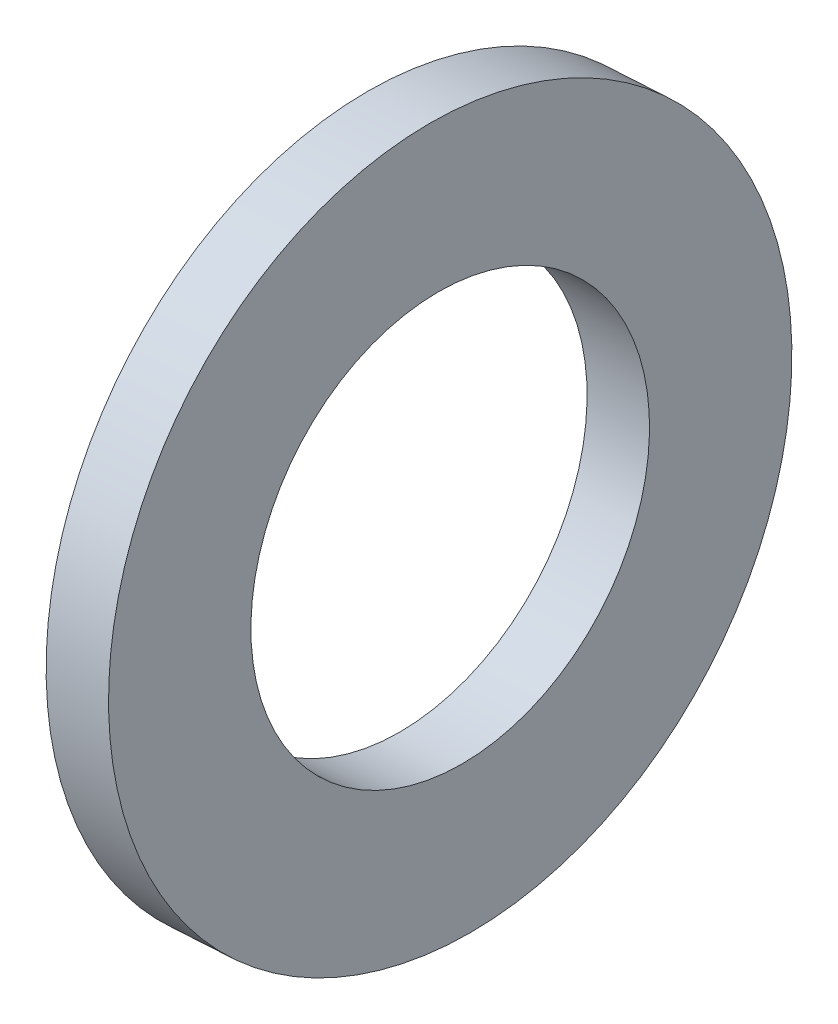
ISO-10303-21;
HEADER;
FILE_DESCRIPTION(('STEP AP214'),'2;1');
FILE_NAME('part.step','',(''),(''),'','','');
FILE_SCHEMA(('AUTOMOTIVE_DESIGN { 1 0 10303 214 1 1 1 1 }'));
ENDSEC;
DATA;
#1=APPLICATION_CONTEXT('core data for automotive mechanical design processes');
#2=APPLICATION_PROTOCOL_DEFINITION('international standard','automotive_design',2000,#1);
#3=PRODUCT_CONTEXT('',#1,'mechanical');
#4=PRODUCT('Part','Part','',(#3));
#5=PRODUCT_RELATED_PRODUCT_CATEGORY('part','',(#4));
#6=PRODUCT_DEFINITION_FORMATION('','',#4);
#7=PRODUCT_DEFINITION_CONTEXT('part definition',#1,'design');
#8=PRODUCT_DEFINITION('design','',#6,#7);
#9=PRODUCT_DEFINITION_SHAPE('','',#8);
#10=(LENGTH_UNIT() NAMED_UNIT(*) SI_UNIT(.MILLI.,.METRE.));
#11=(NAMED_UNIT(*) PLANE_ANGLE_UNIT() SI_UNIT($,.RADIAN.));
#12=(NAMED_UNIT(*) SI_UNIT($,.STERADIAN.) SOLID_ANGLE_UNIT());
#13=UNCERTAINTY_MEASURE_WITH_UNIT(LENGTH_MEASURE(1.E-05),#10,'distance_accuracy_value','');
#14=(GEOMETRIC_REPRESENTATION_CONTEXT(3) GLOBAL_UNCERTAINTY_ASSIGNED_CONTEXT((#13)) GLOBAL_UNIT_ASSIGNED_CONTEXT((#10,
#11,#12)) REPRESENTATION_CONTEXT('',''));
#15=CARTESIAN_POINT('',(0.,0.,0.));
#16=DIRECTION('',(0.,0.,1.));
#17=DIRECTION('',(1.,0.,0.));
#18=AXIS2_PLACEMENT_3D('',#15,#16,#17);
#19=CARTESIAN_POINT('',(11.4027978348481,21.5179000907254,0.));
#20=DIRECTION('',(-0.998253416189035,-0.059077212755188,0.));
#21=DIRECTION('',(0.059077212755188,-0.998253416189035,0.));
#22=AXIS2_PLACEMENT_3D('',#19,#20,#21);
#23=PLANE('',#22);
#24=CARTESIAN_POINT('',(11.4027978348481,21.5179000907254,0.));
#25=DIRECTION('',(0.998253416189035,0.059077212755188,0.));
#26=DIRECTION('',(-0.059077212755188,0.998253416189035,0.));
#27=AXIS2_PLACEMENT_3D('',#24,#25,#26);
#28=CIRCLE('',#27,6.);
#29=CARTESIAN_POINT('',(11.048334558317,27.5074205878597,0.));
#30=VERTEX_POINT('',#29);
#31=EDGE_CURVE('E25',#30,#30,#28,.T.);
#32=ORIENTED_EDGE('',*,*,#31,.F.);
#33=EDGE_LOOP('',(#32));
#34=FACE_BOUND('',#33,.T.);
#35=CARTESIAN_POINT('',(11.4027978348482,21.5179000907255,0.));
#36=DIRECTION('',(0.998253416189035,0.059077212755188,0.));
#37=DIRECTION('',(-0.059077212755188,0.998253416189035,0.));
#38=AXIS2_PLACEMENT_3D('',#35,#36,#37);
#39=CIRCLE('',#38,3.5);
#40=CARTESIAN_POINT('',(11.196027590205,25.0117870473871,0.));
#41=VERTEX_POINT('',#40);
#42=EDGE_CURVE('E16',#41,#41,#39,.T.);
#43=ORIENTED_EDGE('',*,*,#42,.T.);
#44=EDGE_LOOP('',(#43));
#45=FACE_BOUND('',#44,.T.);
#46=ADVANCED_FACE('F13',(#34,#45),#23,.T.);
#47=CARTESIAN_POINT('',(3.61642118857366,21.057097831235,0.));
#48=DIRECTION('',(0.998253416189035,0.059077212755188,0.));
#49=DIRECTION('',(-0.059077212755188,0.998253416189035,0.));
#50=AXIS2_PLACEMENT_3D('',#47,#48,#49);
#51=CYLINDRICAL_SURFACE('',#50,3.5);
#52=ORIENTED_EDGE('',*,*,#42,.F.);
#53=EDGE_LOOP('',(#52));
#54=FACE_BOUND('',#53,.T.);
#55=CARTESIAN_POINT('',(12.5008765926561,21.5828850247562,0.));
#56=DIRECTION('',(0.998253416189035,0.059077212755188,0.));
#57=DIRECTION('',(-0.059077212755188,0.998253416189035,0.));
#58=AXIS2_PLACEMENT_3D('',#55,#56,#57);
#59=CIRCLE('',#58,3.5);
#60=CARTESIAN_POINT('',(12.2941063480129,25.0767719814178,0.));
#61=VERTEX_POINT('',#60);
#62=EDGE_CURVE('E20',#61,#61,#59,.F.);
#63=ORIENTED_EDGE('',*,*,#62,.F.);
#64=EDGE_LOOP('',(#63));
#65=FACE_BOUND('',#64,.T.);
#66=ADVANCED_FACE('F34',(#54,#65),#51,.F.);
#67=CARTESIAN_POINT('',(11.9518372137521,21.5503925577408,0.));
#68=DIRECTION('',(0.998253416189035,0.059077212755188,0.));
#69=DIRECTION('',(-0.059077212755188,0.998253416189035,0.));
#70=AXIS2_PLACEMENT_3D('',#67,#68,#69);
#71=CYLINDRICAL_SURFACE('',#70,6.);
#72=CARTESIAN_POINT('',(12.500876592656,21.5828850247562,0.));
#73=DIRECTION('',(0.998253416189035,0.059077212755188,0.));
#74=DIRECTION('',(-0.059077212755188,0.998253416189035,0.));
#75=AXIS2_PLACEMENT_3D('',#72,#73,#74);
#76=CIRCLE('',#75,6.);
#77=CARTESIAN_POINT('',(12.1464133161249,27.5724055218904,0.));
#78=VERTEX_POINT('',#77);
#79=EDGE_CURVE('E9',#78,#78,#76,.T.);
#80=ORIENTED_EDGE('',*,*,#79,.F.);
#81=EDGE_LOOP('',(#80));
#82=FACE_BOUND('',#81,.T.);
#83=ORIENTED_EDGE('',*,*,#31,.T.);
#84=EDGE_LOOP('',(#83));
#85=FACE_BOUND('',#84,.T.);
#86=ADVANCED_FACE('F37',(#82,#85),#71,.T.);
#87=CARTESIAN_POINT('',(12.5008765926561,21.5828850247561,0.));
#88=DIRECTION('',(0.998253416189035,0.059077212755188,0.));
#89=DIRECTION('',(-0.059077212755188,0.998253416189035,0.));
#90=AXIS2_PLACEMENT_3D('',#87,#88,#89);
#91=PLANE('',#90);
#92=ORIENTED_EDGE('',*,*,#79,.T.);
#93=EDGE_LOOP('',(#92));
#94=FACE_BOUND('',#93,.T.);
#95=ORIENTED_EDGE('',*,*,#62,.T.);
#96=EDGE_LOOP('',(#95));
#97=FACE_BOUND('',#96,.T.);
#98=ADVANCED_FACE('F40',(#94,#97),#91,.T.);
#99=CLOSED_SHELL('',(#46,#66,#86,#98));
#100=MANIFOLD_SOLID_BREP('B1',#99);
#101=ADVANCED_BREP_SHAPE_REPRESENTATION('',(#18,#100),#14);
#102=SHAPE_DEFINITION_REPRESENTATION(#9,#101);
ENDSEC;
END-ISO-10303-21;
